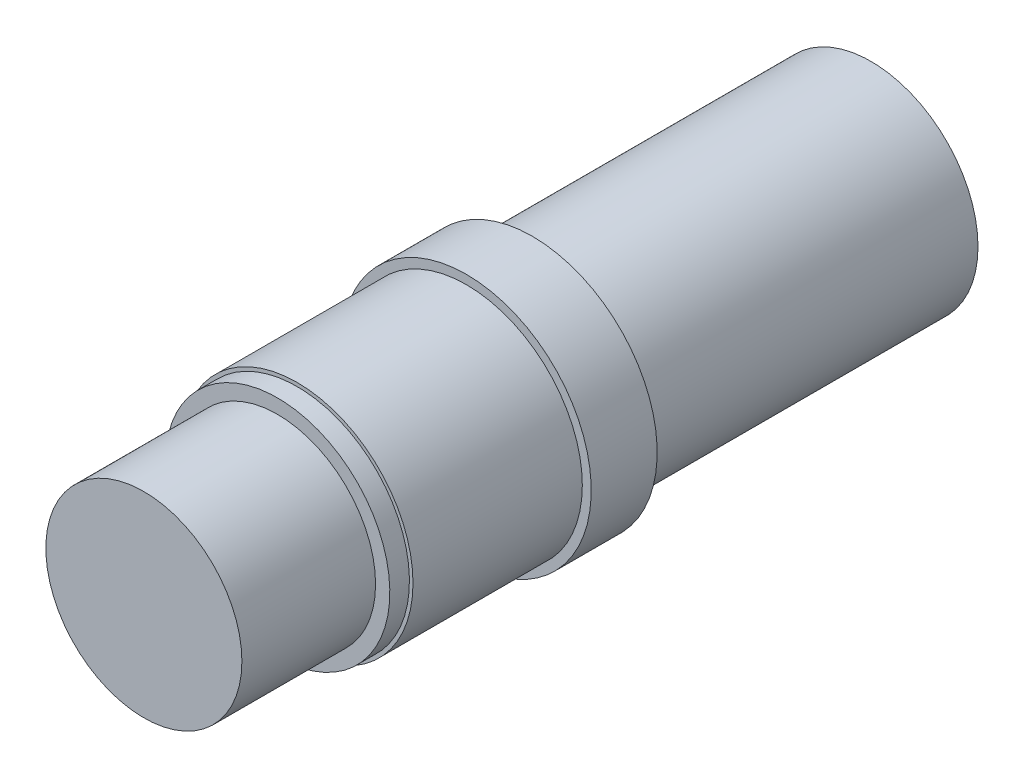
ISO-10303-21;
HEADER;
FILE_DESCRIPTION(('STEP AP214'),'2;1');
FILE_NAME('part.step','',(''),(''),'','','');
FILE_SCHEMA(('AUTOMOTIVE_DESIGN { 1 0 10303 214 1 1 1 1 }'));
ENDSEC;
DATA;
#1=APPLICATION_CONTEXT('core data for automotive mechanical design processes');
#2=APPLICATION_PROTOCOL_DEFINITION('international standard','automotive_design',2000,#1);
#3=PRODUCT_CONTEXT('',#1,'mechanical');
#4=PRODUCT('Part','Part','',(#3));
#5=PRODUCT_RELATED_PRODUCT_CATEGORY('part','',(#4));
#6=PRODUCT_DEFINITION_FORMATION('','',#4);
#7=PRODUCT_DEFINITION_CONTEXT('part definition',#1,'design');
#8=PRODUCT_DEFINITION('design','',#6,#7);
#9=PRODUCT_DEFINITION_SHAPE('','',#8);
#10=(LENGTH_UNIT() NAMED_UNIT(*) SI_UNIT(.MILLI.,.METRE.));
#11=(NAMED_UNIT(*) PLANE_ANGLE_UNIT() SI_UNIT($,.RADIAN.));
#12=(NAMED_UNIT(*) SI_UNIT($,.STERADIAN.) SOLID_ANGLE_UNIT());
#13=UNCERTAINTY_MEASURE_WITH_UNIT(LENGTH_MEASURE(1.E-05),#10,'distance_accuracy_value','');
#14=(GEOMETRIC_REPRESENTATION_CONTEXT(3) GLOBAL_UNCERTAINTY_ASSIGNED_CONTEXT((#13)) GLOBAL_UNIT_ASSIGNED_CONTEXT((#10,
#11,#12)) REPRESENTATION_CONTEXT('',''));
#15=CARTESIAN_POINT('',(0.,0.,0.));
#16=DIRECTION('',(0.,0.,1.));
#17=DIRECTION('',(1.,0.,0.));
#18=AXIS2_PLACEMENT_3D('',#15,#16,#17);
#19=CARTESIAN_POINT('',(-66.1499947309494,-66.1499947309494,333.));
#20=DIRECTION('',(0.,0.,1.));
#21=DIRECTION('',(1.,0.,0.));
#22=AXIS2_PLACEMENT_3D('',#19,#20,#21);
#23=PLANE('',#22);
#24=CARTESIAN_POINT('',(0.,0.,333.));
#25=DIRECTION('',(0.,0.,-1.));
#26=DIRECTION('',(0.,1.,0.));
#27=AXIS2_PLACEMENT_3D('',#24,#25,#26);
#28=CIRCLE('',#27,55.);
#29=CARTESIAN_POINT('',(55.,0.,333.));
#30=VERTEX_POINT('',#29);
#31=EDGE_CURVE('E10',#30,#30,#28,.T.);
#32=ORIENTED_EDGE('',*,*,#31,.T.);
#33=EDGE_LOOP('',(#32));
#34=FACE_BOUND('',#33,.T.);
#35=CARTESIAN_POINT('',(0.,0.,333.));
#36=DIRECTION('',(0.,0.,-1.));
#37=DIRECTION('',(-1.,0.,0.));
#38=AXIS2_PLACEMENT_3D('',#35,#36,#37);
#39=CIRCLE('',#38,63.);
#40=CARTESIAN_POINT('',(0.,-63.,333.));
#41=VERTEX_POINT('',#40);
#42=EDGE_CURVE('E25',#41,#41,#39,.T.);
#43=ORIENTED_EDGE('',*,*,#42,.F.);
#44=EDGE_LOOP('',(#43));
#45=FACE_BOUND('',#44,.T.);
#46=ADVANCED_FACE('F15',(#34,#45),#23,.T.);
#47=CARTESIAN_POINT('',(0.,0.,322.));
#48=DIRECTION('',(0.,0.,1.));
#49=DIRECTION('',(1.,0.,0.));
#50=AXIS2_PLACEMENT_3D('',#47,#48,#49);
#51=CYLINDRICAL_SURFACE('',#50,63.);
#52=CARTESIAN_POINT('',(0.,0.,322.));
#53=DIRECTION('',(0.,0.,-1.));
#54=DIRECTION('',(-1.,0.,0.));
#55=AXIS2_PLACEMENT_3D('',#52,#53,#54);
#56=CIRCLE('',#55,63.);
#57=CARTESIAN_POINT('',(0.,-63.,322.));
#58=VERTEX_POINT('',#57);
#59=EDGE_CURVE('E47',#58,#58,#56,.T.);
#60=ORIENTED_EDGE('',*,*,#59,.F.);
#61=DIRECTION('',(0.,0.,-1.));
#62=VECTOR('',#61,1.);
#63=CARTESIAN_POINT('',(0.,-63.,327.5));
#64=LINE('',#63,#62);
#65=EDGE_CURVE('E92',#41,#58,#64,.T.);
#66=ORIENTED_EDGE('',*,*,#65,.F.);
#67=ORIENTED_EDGE('',*,*,#42,.T.);
#68=ORIENTED_EDGE('',*,*,#65,.T.);
#69=EDGE_LOOP('',(#60,#66,#67,#68));
#70=FACE_BOUND('',#69,.T.);
#71=ADVANCED_FACE('F96',(#70),#51,.T.);
#72=CARTESIAN_POINT('',(-68.2499930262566,68.2499930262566,322.));
#73=DIRECTION('',(0.,0.,1.));
#74=DIRECTION('',(0.,-1.,0.));
#75=AXIS2_PLACEMENT_3D('',#72,#73,#74);
#76=PLANE('',#75);
#77=ORIENTED_EDGE('',*,*,#59,.T.);
#78=EDGE_LOOP('',(#77));
#79=FACE_BOUND('',#78,.T.);
#80=CARTESIAN_POINT('',(0.,0.,322.));
#81=DIRECTION('',(0.,0.,-1.));
#82=DIRECTION('',(-1.,0.,0.));
#83=AXIS2_PLACEMENT_3D('',#80,#81,#82);
#84=CIRCLE('',#83,65.);
#85=CARTESIAN_POINT('',(-65.0000000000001,0.,322.));
#86=VERTEX_POINT('',#85);
#87=EDGE_CURVE('E89',#86,#86,#84,.T.);
#88=ORIENTED_EDGE('',*,*,#87,.F.);
#89=EDGE_LOOP('',(#88));
#90=FACE_BOUND('',#89,.T.);
#91=ADVANCED_FACE('F105',(#79,#90),#76,.T.);
#92=CARTESIAN_POINT('',(0.,0.,227.));
#93=DIRECTION('',(0.,0.,1.));
#94=DIRECTION('',(0.,-1.,0.));
#95=AXIS2_PLACEMENT_3D('',#92,#93,#94);
#96=CYLINDRICAL_SURFACE('',#95,65.);
#97=CARTESIAN_POINT('',(0.,0.,227.));
#98=DIRECTION('',(0.,0.,-1.));
#99=DIRECTION('',(0.,1.,0.));
#100=AXIS2_PLACEMENT_3D('',#97,#98,#99);
#101=CIRCLE('',#100,65.);
#102=CARTESIAN_POINT('',(-65.0000000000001,0.,227.));
#103=VERTEX_POINT('',#102);
#104=EDGE_CURVE('E58',#103,#103,#101,.T.);
#105=ORIENTED_EDGE('',*,*,#104,.F.);
#106=DIRECTION('',(0.,0.,-1.));
#107=VECTOR('',#106,1.);
#108=CARTESIAN_POINT('',(-65.0000000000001,0.,274.5));
#109=LINE('',#108,#107);
#110=EDGE_CURVE('E54',#86,#103,#109,.T.);
#111=ORIENTED_EDGE('',*,*,#110,.F.);
#112=ORIENTED_EDGE('',*,*,#87,.T.);
#113=ORIENTED_EDGE('',*,*,#110,.T.);
#114=EDGE_LOOP('',(#105,#111,#112,#113));
#115=FACE_BOUND('',#114,.T.);
#116=ADVANCED_FACE('F110',(#115),#96,.T.);
#117=CARTESIAN_POINT('',(73.4999999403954,73.4999999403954,227.));
#118=DIRECTION('',(0.,0.,1.));
#119=DIRECTION('',(-1.,0.,0.));
#120=AXIS2_PLACEMENT_3D('',#117,#118,#119);
#121=PLANE('',#120);
#122=ORIENTED_EDGE('',*,*,#104,.T.);
#123=EDGE_LOOP('',(#122));
#124=FACE_BOUND('',#123,.T.);
#125=CARTESIAN_POINT('',(0.,1.04083408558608E-13,227.));
#126=DIRECTION('',(0.,0.,-1.));
#127=DIRECTION('',(-1.,0.,0.));
#128=AXIS2_PLACEMENT_3D('',#125,#126,#127);
#129=CIRCLE('',#128,70.);
#130=CARTESIAN_POINT('',(0.,70.0000000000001,227.));
#131=VERTEX_POINT('',#130);
#132=EDGE_CURVE('E81',#131,#131,#129,.T.);
#133=ORIENTED_EDGE('',*,*,#132,.F.);
#134=EDGE_LOOP('',(#133));
#135=FACE_BOUND('',#134,.T.);
#136=ADVANCED_FACE('F114',(#124,#135),#121,.T.);
#137=CARTESIAN_POINT('',(0.,1.11022302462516E-13,190.));
#138=DIRECTION('',(0.,0.,1.));
#139=DIRECTION('',(1.,0.,0.));
#140=AXIS2_PLACEMENT_3D('',#137,#138,#139);
#141=CYLINDRICAL_SURFACE('',#140,70.);
#142=CARTESIAN_POINT('',(0.,1.11022302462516E-13,190.));
#143=DIRECTION('',(0.,0.,1.));
#144=DIRECTION('',(1.,0.,0.));
#145=AXIS2_PLACEMENT_3D('',#142,#143,#144);
#146=CIRCLE('',#145,70.);
#147=CARTESIAN_POINT('',(0.,70.0000000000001,190.));
#148=VERTEX_POINT('',#147);
#149=EDGE_CURVE('E84',#148,#148,#146,.T.);
#150=ORIENTED_EDGE('',*,*,#149,.T.);
#151=DIRECTION('',(0.,0.,-1.));
#152=VECTOR('',#151,1.);
#153=CARTESIAN_POINT('',(0.,70.0000000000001,208.5));
#154=LINE('',#153,#152);
#155=EDGE_CURVE('E79',#131,#148,#154,.T.);
#156=ORIENTED_EDGE('',*,*,#155,.F.);
#157=ORIENTED_EDGE('',*,*,#132,.T.);
#158=ORIENTED_EDGE('',*,*,#155,.T.);
#159=EDGE_LOOP('',(#150,#156,#157,#158));
#160=FACE_BOUND('',#159,.T.);
#161=ADVANCED_FACE('F117',(#160),#141,.T.);
#162=CARTESIAN_POINT('',(-73.4999999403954,-73.4999999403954,190.));
#163=DIRECTION('',(0.,0.,-1.));
#164=DIRECTION('',(0.,1.,0.));
#165=AXIS2_PLACEMENT_3D('',#162,#163,#164);
#166=PLANE('',#165);
#167=CARTESIAN_POINT('',(0.,0.,190.));
#168=DIRECTION('',(0.,0.,-1.));
#169=DIRECTION('',(0.,1.,0.));
#170=AXIS2_PLACEMENT_3D('',#167,#168,#169);
#171=CIRCLE('',#170,60.);
#172=CARTESIAN_POINT('',(60.,0.,190.));
#173=VERTEX_POINT('',#172);
#174=EDGE_CURVE('E71',#173,#173,#171,.T.);
#175=ORIENTED_EDGE('',*,*,#174,.F.);
#176=EDGE_LOOP('',(#175));
#177=FACE_BOUND('',#176,.T.);
#178=ORIENTED_EDGE('',*,*,#149,.F.);
#179=EDGE_LOOP('',(#178));
#180=FACE_BOUND('',#179,.T.);
#181=ADVANCED_FACE('F121',(#177,#180),#166,.T.);
#182=CARTESIAN_POINT('',(0.,0.,0.));
#183=DIRECTION('',(0.,0.,1.));
#184=DIRECTION('',(1.,0.,0.));
#185=AXIS2_PLACEMENT_3D('',#182,#183,#184);
#186=CYLINDRICAL_SURFACE('',#185,60.);
#187=CARTESIAN_POINT('',(0.,0.,0.));
#188=DIRECTION('',(0.,0.,1.));
#189=DIRECTION('',(1.,0.,0.));
#190=AXIS2_PLACEMENT_3D('',#187,#188,#189);
#191=CIRCLE('',#190,60.);
#192=CARTESIAN_POINT('',(60.,0.,0.));
#193=VERTEX_POINT('',#192);
#194=EDGE_CURVE('E76',#193,#193,#191,.T.);
#195=ORIENTED_EDGE('',*,*,#194,.T.);
#196=DIRECTION('',(0.,0.,-1.));
#197=VECTOR('',#196,1.);
#198=CARTESIAN_POINT('',(60.,0.,95.));
#199=LINE('',#198,#197);
#200=EDGE_CURVE('E70',#173,#193,#199,.T.);
#201=ORIENTED_EDGE('',*,*,#200,.F.);
#202=ORIENTED_EDGE('',*,*,#174,.T.);
#203=ORIENTED_EDGE('',*,*,#200,.T.);
#204=EDGE_LOOP('',(#195,#201,#202,#203));
#205=FACE_BOUND('',#204,.T.);
#206=ADVANCED_FACE('F125',(#205),#186,.T.);
#207=CARTESIAN_POINT('',(-62.9999935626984,62.9999935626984,0.));
#208=DIRECTION('',(0.,0.,-1.));
#209=DIRECTION('',(1.,0.,0.));
#210=AXIS2_PLACEMENT_3D('',#207,#208,#209);
#211=PLANE('',#210);
#212=ORIENTED_EDGE('',*,*,#194,.F.);
#213=EDGE_LOOP('',(#212));
#214=FACE_BOUND('',#213,.T.);
#215=ADVANCED_FACE('F129',(#214),#211,.T.);
#216=CARTESIAN_POINT('',(0.,0.,333.));
#217=DIRECTION('',(0.,0.,1.));
#218=DIRECTION('',(0.,-1.,0.));
#219=AXIS2_PLACEMENT_3D('',#216,#217,#218);
#220=CYLINDRICAL_SURFACE('',#219,55.);
#221=ORIENTED_EDGE('',*,*,#31,.F.);
#222=DIRECTION('',(0.,0.,-1.));
#223=VECTOR('',#222,1.);
#224=CARTESIAN_POINT('',(55.,0.,370.5));
#225=LINE('',#224,#223);
#226=CARTESIAN_POINT('',(55.,0.,408.));
#227=VERTEX_POINT('',#226);
#228=EDGE_CURVE('E19',#227,#30,#225,.T.);
#229=ORIENTED_EDGE('',*,*,#228,.F.);
#230=CARTESIAN_POINT('',(0.,0.,408.));
#231=DIRECTION('',(0.,0.,-1.));
#232=DIRECTION('',(0.,1.,0.));
#233=AXIS2_PLACEMENT_3D('',#230,#231,#232);
#234=CIRCLE('',#233,55.);
#235=EDGE_CURVE('E69',#227,#227,#234,.T.);
#236=ORIENTED_EDGE('',*,*,#235,.T.);
#237=ORIENTED_EDGE('',*,*,#228,.T.);
#238=EDGE_LOOP('',(#221,#229,#236,#237));
#239=FACE_BOUND('',#238,.T.);
#240=ADVANCED_FACE('F132',(#239),#220,.T.);
#241=CARTESIAN_POINT('',(57.7499978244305,-57.7499978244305,408.));
#242=DIRECTION('',(0.,0.,1.));
#243=DIRECTION('',(0.,1.,0.));
#244=AXIS2_PLACEMENT_3D('',#241,#242,#243);
#245=PLANE('',#244);
#246=ORIENTED_EDGE('',*,*,#235,.F.);
#247=EDGE_LOOP('',(#246));
#248=FACE_BOUND('',#247,.T.);
#249=ADVANCED_FACE('F17',(#248),#245,.T.);
#250=CLOSED_SHELL('',(#46,#71,#91,#116,#136,#161,#181,#206,#215,#240,#249));
#251=MANIFOLD_SOLID_BREP('B1',#250);
#252=ADVANCED_BREP_SHAPE_REPRESENTATION('',(#18,#251),#14);
#253=SHAPE_DEFINITION_REPRESENTATION(#9,#252);
ENDSEC;
END-ISO-10303-21;
